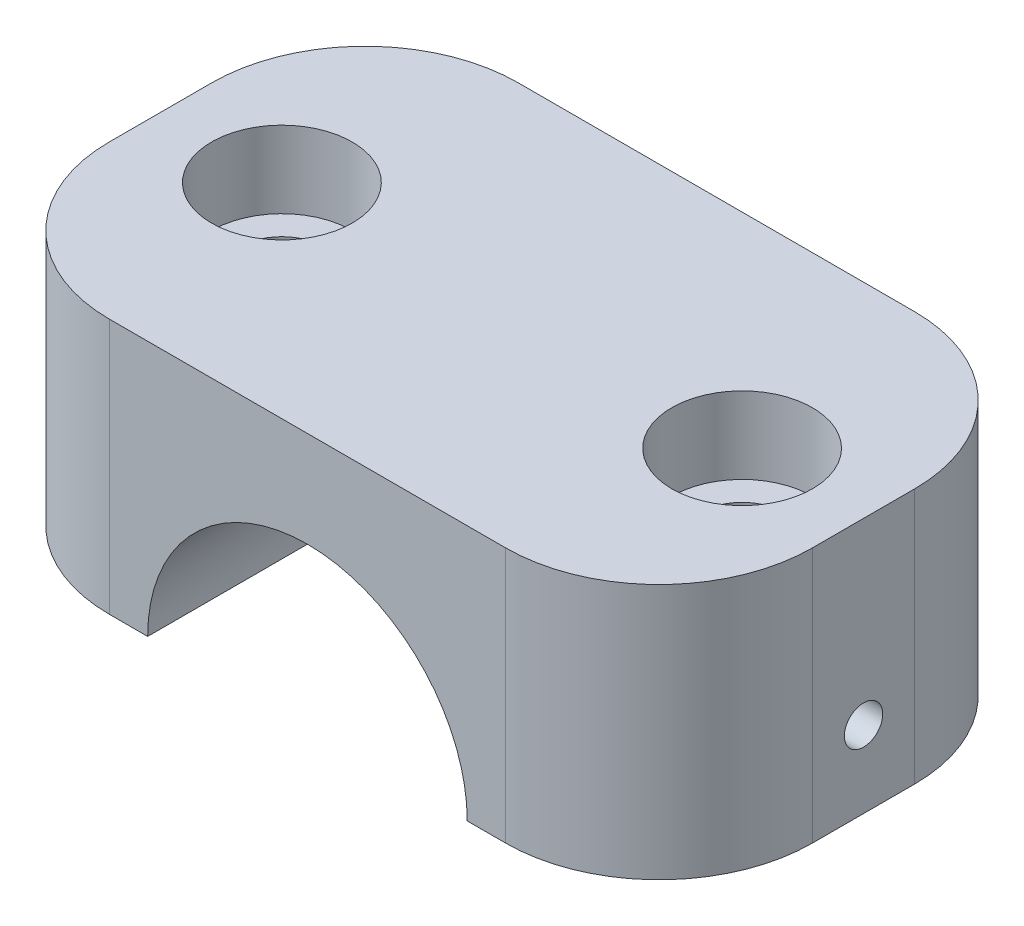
from build123d import *

# Parameters (mm, degrees)
SKETCH1_W                      = 55
SKETCH1_H                      = 20
EXTRUDE1_DEPTH                 = 16
CUT_EXTRUDE1_DEPTH             = 47.693147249
CUT_EXTRUDE1_DEPTH_BACK        = 47.693147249
FILLET1_R                      = 12
CBORE_FOR_M6_SHCS1_D           = 6.6
CBORE_FOR_M6_SHCS1_CBORE_D     = 11
CBORE_FOR_M6_SHCS1_CBORE_DEPTH = 6


with BuildPart() as part:
    # Sketch1 → Extrude1 (new, symmetric)
    with BuildSketch(Plane.XY):
        with Locations((0, 10)):
            Rectangle(SKETCH1_W, SKETCH1_H)
    extrude(amount=EXTRUDE1_DEPTH, both=True)

    # Sketch2 → Cut-Extrude1 (cut, two sides: drawn at the far end of the back side and taken through both)
    with BuildSketch(Plane.XY.offset(16).offset(-CUT_EXTRUDE1_DEPTH_BACK)):
        with BuildLine():
            Line((12.5, -99.4427191), (12.5, 0))
            ThreePointArc((12.5, 0), (0, 12.5), (-12.5, 0))
            Line((-12.5, 0), (-12.5, -99.4427191))
            Line((-12.5, -99.4427191), (-12.5, -298.3281573))
            Line((-12.5, -298.3281573), (12.5, -298.3281573))
            Line((12.5, -298.3281573), (12.5, -99.4427191))
        make_face()
    extrude(amount=CUT_EXTRUDE1_DEPTH + CUT_EXTRUDE1_DEPTH_BACK, mode=Mode.SUBTRACT)

    # Fillet1
    fillet1_edges = [part.edges().sort_by_distance(p)[0] for p in [
        (27.5, 10, 16),
        (-27.5, 10, 16),
        (27.5, 10, -16),
        (-27.5, 10, -16),
    ]]
    fillet(fillet1_edges, radius=FILLET1_R)

    # CBORE for M6 SHCS1 (through all)
    with Locations(Plane(origin=(0, 20, 0), x_dir=(-1, 0, 0), z_dir=(0, 1, 0))):
        with Locations((18, 0)):
            cbore_for_m6_shcs1 = CounterBoreHole(CBORE_FOR_M6_SHCS1_D / 2, CBORE_FOR_M6_SHCS1_CBORE_D / 2, CBORE_FOR_M6_SHCS1_CBORE_DEPTH)

    # Sketch5 → M3.0 _3_ Diameter Hole1 (revolve, cut)
    with BuildSketch(Plane(origin=(27.5, 6, 0), x_dir=(0, 0, -1), z_dir=(0, 1, 0))):
        Polygon((0, 0), (0, 4.901290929), (1.5, 4), (1.5, 0), align=None)
    m3_0_3_diameter_hole1 = revolve(axis=Axis((33.85, 6, 0), (-1, 0, 0)), mode=Mode.SUBTRACT)

    # Mirror1: CBORE for M6 SHCS1, M3.0 _3_ Diameter Hole1 across plane
    add(cbore_for_m6_shcs1.mirror(Plane(origin=(0, 0, 0), x_dir=(0, 0, 1), z_dir=(1, 0, 0))), mode=Mode.SUBTRACT)
    add(m3_0_3_diameter_hole1.mirror(Plane(origin=(0, 0, 0), x_dir=(0, 0, 1), z_dir=(1, 0, 0))), mode=Mode.SUBTRACT)


solid = part.part
